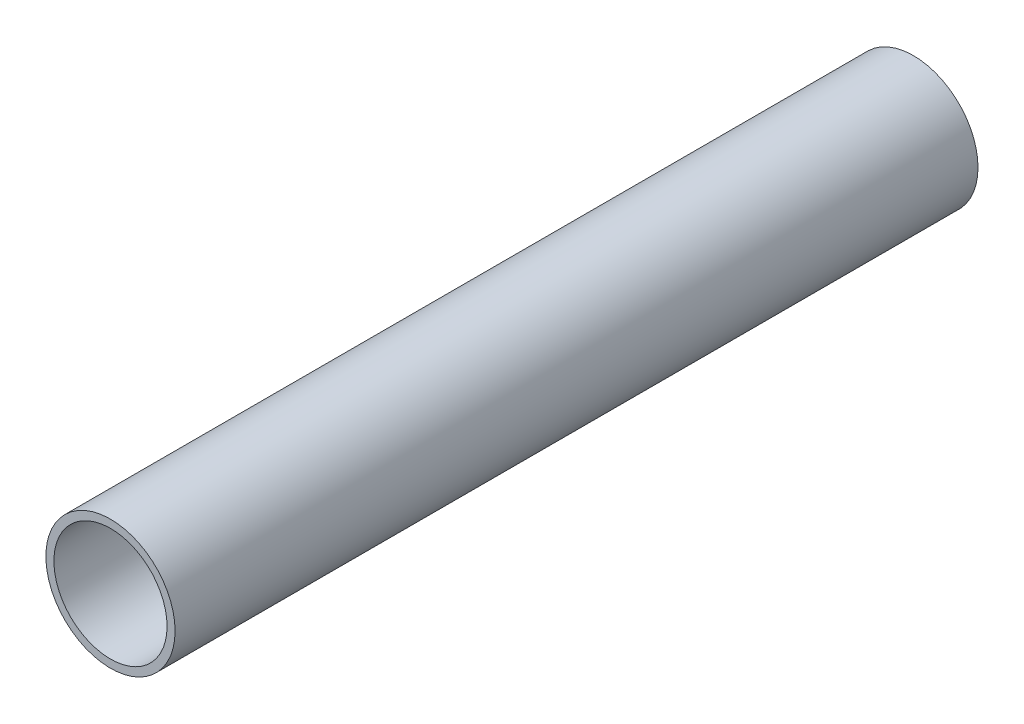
ISO-10303-21;
HEADER;
FILE_DESCRIPTION(('STEP AP214'),'2;1');
FILE_NAME('part.step','',(''),(''),'','','');
FILE_SCHEMA(('AUTOMOTIVE_DESIGN { 1 0 10303 214 1 1 1 1 }'));
ENDSEC;
DATA;
#1=APPLICATION_CONTEXT('core data for automotive mechanical design processes');
#2=APPLICATION_PROTOCOL_DEFINITION('international standard','automotive_design',2000,#1);
#3=PRODUCT_CONTEXT('',#1,'mechanical');
#4=PRODUCT('Part','Part','',(#3));
#5=PRODUCT_RELATED_PRODUCT_CATEGORY('part','',(#4));
#6=PRODUCT_DEFINITION_FORMATION('','',#4);
#7=PRODUCT_DEFINITION_CONTEXT('part definition',#1,'design');
#8=PRODUCT_DEFINITION('design','',#6,#7);
#9=PRODUCT_DEFINITION_SHAPE('','',#8);
#10=(LENGTH_UNIT() NAMED_UNIT(*) SI_UNIT(.MILLI.,.METRE.));
#11=(NAMED_UNIT(*) PLANE_ANGLE_UNIT() SI_UNIT($,.RADIAN.));
#12=(NAMED_UNIT(*) SI_UNIT($,.STERADIAN.) SOLID_ANGLE_UNIT());
#13=UNCERTAINTY_MEASURE_WITH_UNIT(LENGTH_MEASURE(1.E-05),#10,'distance_accuracy_value','');
#14=(GEOMETRIC_REPRESENTATION_CONTEXT(3) GLOBAL_UNCERTAINTY_ASSIGNED_CONTEXT((#13)) GLOBAL_UNIT_ASSIGNED_CONTEXT((#10,
#11,#12)) REPRESENTATION_CONTEXT('',''));
#15=CARTESIAN_POINT('',(0.,0.,0.));
#16=DIRECTION('',(0.,0.,1.));
#17=DIRECTION('',(1.,0.,0.));
#18=AXIS2_PLACEMENT_3D('',#15,#16,#17);
#19=CARTESIAN_POINT('',(0.,0.,276.225));
#20=DIRECTION('',(0.,0.,1.));
#21=DIRECTION('',(1.,0.,0.));
#22=AXIS2_PLACEMENT_3D('',#19,#20,#21);
#23=PLANE('',#22);
#24=CARTESIAN_POINT('',(0.,0.,276.225));
#25=DIRECTION('',(0.,0.,1.));
#26=DIRECTION('',(1.,0.,0.));
#27=AXIS2_PLACEMENT_3D('',#24,#25,#26);
#28=CIRCLE('',#27,44.45);
#29=CARTESIAN_POINT('',(44.45,0.,276.225));
#30=VERTEX_POINT('',#29);
#31=EDGE_CURVE('E10',#30,#30,#28,.T.);
#32=ORIENTED_EDGE('',*,*,#31,.T.);
#33=EDGE_LOOP('',(#32));
#34=FACE_BOUND('',#33,.T.);
#35=CARTESIAN_POINT('',(0.,0.,276.225));
#36=DIRECTION('',(0.,0.,1.));
#37=DIRECTION('',(1.,0.,0.));
#38=AXIS2_PLACEMENT_3D('',#35,#36,#37);
#39=CIRCLE('',#38,38.9382);
#40=CARTESIAN_POINT('',(38.9382,0.,276.225));
#41=VERTEX_POINT('',#40);
#42=EDGE_CURVE('E45',#41,#41,#39,.T.);
#43=ORIENTED_EDGE('',*,*,#42,.F.);
#44=EDGE_LOOP('',(#43));
#45=FACE_BOUND('',#44,.T.);
#46=ADVANCED_FACE('F34',(#34,#45),#23,.T.);
#47=CARTESIAN_POINT('',(0.,0.,-276.225));
#48=DIRECTION('',(0.,0.,1.));
#49=DIRECTION('',(1.,0.,0.));
#50=AXIS2_PLACEMENT_3D('',#47,#48,#49);
#51=PLANE('',#50);
#52=CARTESIAN_POINT('',(0.,0.,-276.225));
#53=DIRECTION('',(0.,0.,1.));
#54=DIRECTION('',(1.,0.,0.));
#55=AXIS2_PLACEMENT_3D('',#52,#53,#54);
#56=CIRCLE('',#55,44.45);
#57=CARTESIAN_POINT('',(44.45,0.,-276.225));
#58=VERTEX_POINT('',#57);
#59=EDGE_CURVE('E41',#58,#58,#56,.T.);
#60=ORIENTED_EDGE('',*,*,#59,.F.);
#61=EDGE_LOOP('',(#60));
#62=FACE_BOUND('',#61,.T.);
#63=CARTESIAN_POINT('',(0.,0.,-276.225));
#64=DIRECTION('',(0.,0.,1.));
#65=DIRECTION('',(1.,0.,0.));
#66=AXIS2_PLACEMENT_3D('',#63,#64,#65);
#67=CIRCLE('',#66,38.9382);
#68=CARTESIAN_POINT('',(38.9382,0.,-276.225));
#69=VERTEX_POINT('',#68);
#70=EDGE_CURVE('E49',#69,#69,#67,.T.);
#71=ORIENTED_EDGE('',*,*,#70,.T.);
#72=EDGE_LOOP('',(#71));
#73=FACE_BOUND('',#72,.T.);
#74=ADVANCED_FACE('F55',(#62,#73),#51,.F.);
#75=CARTESIAN_POINT('',(0.,0.,276.225));
#76=DIRECTION('',(0.,0.,-1.));
#77=DIRECTION('',(-1.,0.,0.));
#78=AXIS2_PLACEMENT_3D('',#75,#76,#77);
#79=CYLINDRICAL_SURFACE('',#78,44.45);
#80=ORIENTED_EDGE('',*,*,#31,.F.);
#81=EDGE_LOOP('',(#80));
#82=FACE_BOUND('',#81,.T.);
#83=ORIENTED_EDGE('',*,*,#59,.T.);
#84=EDGE_LOOP('',(#83));
#85=FACE_BOUND('',#84,.T.);
#86=ADVANCED_FACE('F36',(#82,#85),#79,.T.);
#87=CARTESIAN_POINT('',(0.,0.,276.225));
#88=DIRECTION('',(0.,0.,-1.));
#89=DIRECTION('',(-1.,0.,0.));
#90=AXIS2_PLACEMENT_3D('',#87,#88,#89);
#91=CYLINDRICAL_SURFACE('',#90,38.9382);
#92=ORIENTED_EDGE('',*,*,#42,.T.);
#93=EDGE_LOOP('',(#92));
#94=FACE_BOUND('',#93,.T.);
#95=ORIENTED_EDGE('',*,*,#70,.F.);
#96=EDGE_LOOP('',(#95));
#97=FACE_BOUND('',#96,.T.);
#98=ADVANCED_FACE('F57',(#94,#97),#91,.F.);
#99=CLOSED_SHELL('',(#46,#74,#86,#98));
#100=MANIFOLD_SOLID_BREP('B2',#99);
#101=ADVANCED_BREP_SHAPE_REPRESENTATION('',(#18,#100),#14);
#102=SHAPE_DEFINITION_REPRESENTATION(#9,#101);
ENDSEC;
END-ISO-10303-21;
